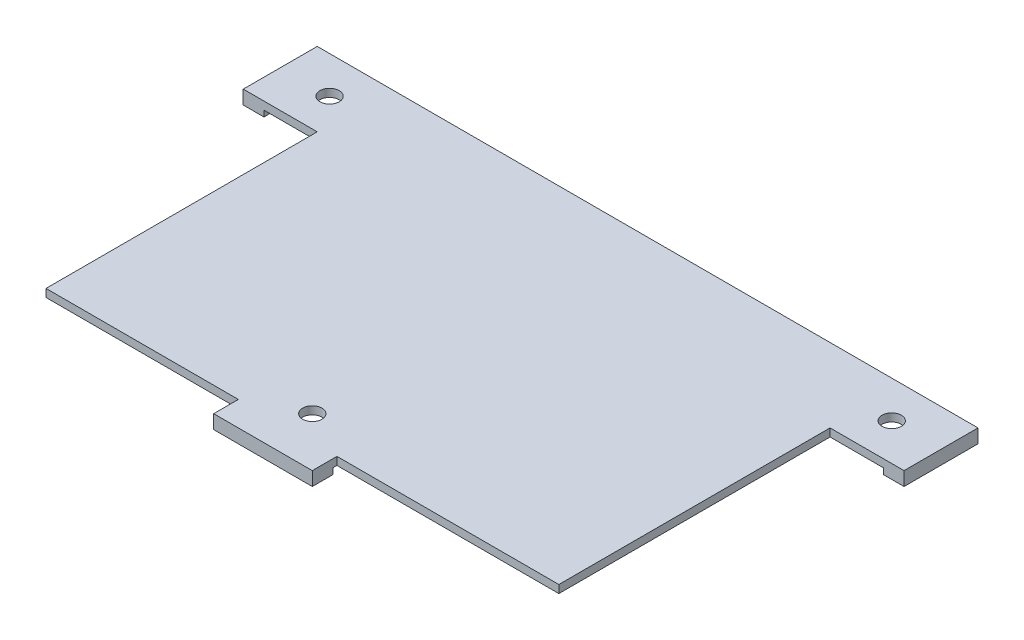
from build123d import *

# Parameters (mm, degrees)
SKETCH1_W           = 78.74
SKETCH1_H           = 44.45
SKETCH1_R           = 1.2446
BOSS_EXTRUDE1_DEPTH = 1.016
SKETCH2_W           = 3.175
SKETCH2_H           = 9.525
SKETCH2_W_2         = 12.7
SKETCH2_H_2         = 3.175
BOSS_EXTRUDE2_DEPTH = 1.778
SKETCH3_W           = 0.508
SKETCH3_H           = 9.525
SKETCH3_W_2         = 12.7
SKETCH3_H_2         = 0.508
CUT_EXTRUDE1_DEPTH  = 0.762
SKETCH4_W           = 6.35
SKETCH4_H           = 34.925
CUT_EXTRUDE2_DEPTH  = 61.684342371
CUT_EXTRUDE3_DEPTH  = 0.508


with BuildPart() as part:
    # Sketch1 → Boss-Extrude1 (new body)
    with BuildSketch(Plane(origin=(0, 0, 0), x_dir=(1, 0, 0), z_dir=(0, 1, 0))):
        with Locations((1.905, 19.05)):
            Rectangle(SKETCH1_W, SKETCH1_H)
        with Locations(Location((-34.29, 36.5125, 0), (0, 0, 270))):
            Circle(SKETCH1_R, mode=Mode.SUBTRACT)
        with Locations(Location((0, 0, 0), (0, 0, 270))):
            Circle(SKETCH1_R, mode=Mode.SUBTRACT)
        with Locations(Location((38.1, 36.5125, 0), (0, 0, 270))):
            Circle(SKETCH1_R, mode=Mode.SUBTRACT)
    extrude(amount=BOSS_EXTRUDE1_DEPTH)

    # Sketch2 → Boss-Extrude2 (add)
    with BuildSketch(Plane(origin=(0, 1.016, 0), x_dir=(1, 0, 0), z_dir=(0, 1, 0))):
        with Locations((-39.0525, 36.5125)):
            Rectangle(SKETCH2_W, SKETCH2_H)
        with Locations((0, -4.7625)):
            Rectangle(SKETCH2_W_2, SKETCH2_H_2)
        with Locations((42.8625, 36.5125)):
            Rectangle(SKETCH2_W, SKETCH2_H)
    extrude(amount=-BOSS_EXTRUDE2_DEPTH)

    # Sketch3 → Cut-Extrude1 (cut)
    with BuildSketch(Plane.XZ.offset(0.762)):
        with Locations((41.529, -36.5125)):
            Rectangle(SKETCH3_W, SKETCH3_H)
        with Locations((-37.719, -36.5125)):
            Rectangle(SKETCH3_W, SKETCH3_H)
        with Locations((0, 3.429)):
            Rectangle(SKETCH3_W_2, SKETCH3_H_2)
    extrude(amount=-CUT_EXTRUDE1_DEPTH, mode=Mode.SUBTRACT)

    # Sketch4 → Cut-Extrude2 (cut, through all)
    with BuildSketch(Plane(origin=(0, 1.016, 0), x_dir=(1, 0, 0), z_dir=(0, 1, 0))):
        with Locations((-34.29, 14.2875)):
            Rectangle(SKETCH4_W, SKETCH4_H)
        with Locations((38.1, 14.2875)):
            Rectangle(SKETCH4_W, SKETCH4_H)
    extrude(amount=-CUT_EXTRUDE2_DEPTH, mode=Mode.SUBTRACT)

    # Sketch5 → Cut-Extrude3 (cut)
    with BuildSketch(Plane.XZ):
        with BuildLine():
            add(Edge.make_bspline(
                [(3.134145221, -16.379848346), (3.152145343, -16.329716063), (3.185472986, -16.236894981), (3.256376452, -16.108494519), (3.370957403, -16.01159666), (3.534453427, -15.950235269), (3.748399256, -15.904089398), (3.967545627, -15.889946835), (4.177866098, -15.88366824), (4.366557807, -15.876977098), (4.578645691, -15.874409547), (4.727481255, -15.874795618), (4.806272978, -15.875)],
                knots=[0, 0, 0, 0, 0.844651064, 1.56389098, 2.296395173, 3.166964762, 4.304182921, 5.758768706, 6.638168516, 7.640850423, 8.751095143, 10, 10, 10, 10], degree=3))
            add(Edge.make_bspline(
                [(4.806272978, -15.875), (4.928851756, -15.874212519), (5.155543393, -15.872756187), (5.46960752, -15.881938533), (5.733733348, -15.882250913), (5.953401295, -15.902754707), (6.133959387, -15.921287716), (6.280086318, -15.958596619), (6.39859777, -16.00094709), (6.495077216, -16.055023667), (6.575101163, -16.118065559), (6.627400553, -16.203619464), (6.672200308, -16.299923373), (6.696060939, -16.370786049), (6.708938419, -16.409030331)],
                knots=[0, 0, 0, 0, 2.065582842, 3.8199953, 5.29577587, 6.512877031, 7.537701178, 8.348807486, 9.049138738, 9.651028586, 10.209371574, 10.741340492, 11.320706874, 12, 12, 12, 12], degree=3))
            Line((6.708938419, -16.409030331), (10.552205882, -27.56238511))
            add(Edge.make_bspline(
                [(10.552205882, -27.56238511), (10.569661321, -27.617835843), (10.602360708, -27.721712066), (10.649320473, -27.868277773), (10.676988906, -27.998520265), (10.696829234, -28.111278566), (10.701372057, -28.208711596), (10.688140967, -28.294666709), (10.651259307, -28.36691929), (10.59647296, -28.428031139), (10.520432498, -28.475048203), (10.423450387, -28.508345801), (10.307599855, -28.538157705), (10.167393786, -28.554287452), (10.002615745, -28.56019061), (9.809163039, -28.571504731), (9.586265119, -28.571606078), (9.427720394, -28.573827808), (9.344071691, -28.575)],
                knots=[0, 0, 0, 0, 1.276256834, 2.390820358, 3.375060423, 4.196456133, 4.901368, 5.508657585, 6.081569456, 6.656070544, 7.28980822, 8.019505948, 8.899837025, 9.911485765, 11.108865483, 12.51949737, 14.163675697, 16, 16, 16, 16], degree=3))
            add(Edge.make_bspline(
                [(9.344071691, -28.575), (9.272076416, -28.575763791), (9.136812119, -28.577198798), (8.946278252, -28.567817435), (8.779758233, -28.568171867), (8.600300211, -28.556837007), (8.419361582, -28.533827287), (8.244052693, -28.498212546), (8.115255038, -28.436651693), (8.033171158, -28.342676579), (7.982823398, -28.226842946), (7.953464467, -28.144246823), (7.9375, -28.09933364)],
                knots=[0, 0, 0, 0, 1.326763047, 2.492714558, 3.51483795, 4.39501526, 5.804941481, 6.874702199, 7.684698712, 8.383018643, 9.120736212, 10, 10, 10, 10], degree=3))
            Line((7.9375, -28.09933364), (4.771254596, -18.393405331))
            Line((4.771254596, -18.393405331), (4.7625, -18.393405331))
            Line((4.7625, -18.393405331), (1.774264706, -28.049724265))
            add(Edge.make_bspline(
                [(1.774264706, -28.049724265), (1.759735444, -28.099624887), (1.732922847, -28.191712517), (1.679962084, -28.317963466), (1.592573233, -28.420652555), (1.457521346, -28.488777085), (1.274439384, -28.537639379), (1.085014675, -28.555906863), (0.898970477, -28.568412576), (0.726566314, -28.567756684), (0.529234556, -28.577179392), (0.389106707, -28.57575278), (0.315165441, -28.575)],
                knots=[0, 0, 0, 0, 0.91043742, 1.680139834, 2.380365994, 3.219151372, 4.281370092, 5.688436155, 6.541625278, 7.546725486, 8.705480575, 10, 10, 10, 10], degree=3))
            add(Edge.make_bspline(
                [(0.315165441, -28.575), (0.243180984, -28.574258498), (0.106970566, -28.572855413), (-0.084725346, -28.567384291), (-0.251058, -28.558324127), (-0.392731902, -28.548903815), (-0.511132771, -28.528691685), (-0.610095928, -28.500357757), (-0.689505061, -28.461002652), (-0.76948072, -28.391483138), (-0.822435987, -28.25939506), (-0.81238704, -28.064710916), (-0.749112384, -27.823748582), (-0.68813878, -27.645578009), (-0.653676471, -27.544875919)],
                knots=[0, 0, 0, 0, 1.299602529, 2.459133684, 3.461472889, 4.307303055, 5.020401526, 5.625923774, 6.160008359, 6.607717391, 7.511704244, 8.60046101, 10.078579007, 12, 12, 12, 12], degree=3))
            Line((-0.653676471, -27.544875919), (3.134145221, -16.379848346))
        make_face()
        with BuildLine():
            add(Edge.make_bspline(
                [(-10.458823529, -16.88761489), (-10.456943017, -16.800016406), (-10.453489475, -16.639142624), (-10.434291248, -16.418523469), (-10.402553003, -16.239224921), (-10.35222736, -16.100899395), (-10.294292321, -15.998288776), (-10.227403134, -15.925500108), (-10.148440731, -15.880295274), (-10.090695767, -15.876759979), (-10.061948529, -15.875)],
                knots=[0, 0, 0, 0, 1.771487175, 3.253319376, 4.476326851, 5.441070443, 6.217065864, 6.843188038, 7.424103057, 8, 8, 8, 8], degree=3))
            Line((-10.061948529, -15.875), (-2.999908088, -15.875))
            add(Edge.make_bspline(
                [(-2.999908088, -15.875), (-2.973978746, -15.87683163), (-2.920662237, -15.880597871), (-2.848249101, -15.928456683), (-2.778759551, -15.996754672), (-2.721631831, -16.101244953), (-2.67068217, -16.239079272), (-2.640224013, -16.418752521), (-2.615236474, -16.638862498), (-2.614892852, -16.799959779), (-2.614705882, -16.88761489)],
                knots=[0, 0, 0, 0, 0.522562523, 1.074505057, 1.720647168, 2.504239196, 3.478427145, 4.713407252, 6.211722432, 8, 8, 8, 8], degree=3))
            add(Edge.make_bspline(
                [(-2.614705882, -16.88761489), (-2.615279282, -16.977156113), (-2.616328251, -17.140961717), (-2.636611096, -17.364396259), (-2.667285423, -17.546615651), (-2.710770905, -17.690856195), (-2.771631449, -17.79788769), (-2.838104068, -17.87541862), (-2.919574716, -17.920433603), (-2.977054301, -17.92642249), (-3.005744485, -17.929411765)],
                knots=[0, 0, 0, 0, 1.77343106, 3.244292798, 4.438837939, 5.432227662, 6.209101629, 6.863778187, 7.432869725, 8, 8, 8, 8], degree=3))
            Line((-3.005744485, -17.929411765), (-5.416176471, -17.929411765))
            Line((-5.416176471, -17.929411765), (-5.416176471, -25.960294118))
            Line((-5.416176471, -25.960294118), (-3.355928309, -24.839705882))
            add(Edge.make_bspline(
                [(-3.355928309, -24.839705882), (-3.287519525, -24.808499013), (-3.167657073, -24.753819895), (-3.000742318, -24.706051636), (-2.858617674, -24.694339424), (-2.744751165, -24.76398883), (-2.673491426, -24.894776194), (-2.636773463, -25.082899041), (-2.615214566, -25.341093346), (-2.614891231, -25.538057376), (-2.614705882, -25.650965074)],
                knots=[0, 0, 0, 0, 1.162412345, 2.03672083, 2.700285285, 3.295173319, 3.985778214, 4.947776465, 6.250342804, 8, 8, 8, 8], degree=3))
            add(Edge.make_bspline(
                [(-2.614705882, -25.650965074), (-2.615195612, -25.723931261), (-2.616084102, -25.856309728), (-2.623794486, -26.03656018), (-2.639746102, -26.185650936), (-2.670756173, -26.309072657), (-2.717179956, -26.412172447), (-2.783791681, -26.495135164), (-2.867923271, -26.571987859), (-2.934054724, -26.617767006), (-2.970726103, -26.643152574)],
                knots=[0, 0, 0, 0, 1.565715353, 2.840589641, 3.871072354, 4.77736535, 5.561752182, 6.275764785, 7.043872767, 8, 8, 8, 8], degree=3))
            Line((-2.970726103, -26.643152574), (-5.719669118, -28.443681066))
            add(Edge.make_bspline(
                [(-5.719669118, -28.443681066), (-5.737669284, -28.457128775), (-5.775998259, -28.485763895), (-5.849084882, -28.51462479), (-5.939275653, -28.532205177), (-6.049367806, -28.55620131), (-6.191427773, -28.564025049), (-6.371228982, -28.5743891), (-6.599043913, -28.575215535), (-6.767313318, -28.575076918), (-6.860684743, -28.575)],
                knots=[0, 0, 0, 0, 0.461896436, 0.983547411, 1.601620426, 2.357138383, 3.303531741, 4.528884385, 6.07390409, 8, 8, 8, 8], degree=3))
            add(Edge.make_bspline(
                [(-6.860684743, -28.575), (-6.975451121, -28.574698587), (-7.180749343, -28.57415941), (-7.454672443, -28.564848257), (-7.663567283, -28.542659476), (-7.818646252, -28.522773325), (-7.925826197, -28.481573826), (-7.997040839, -28.42661521), (-8.026754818, -28.351682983), (-8.029470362, -28.300854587), (-8.030882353, -28.274425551)],
                knots=[0, 0, 0, 0, 2.093727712, 3.74533535, 4.993527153, 5.929870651, 6.582266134, 7.073008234, 7.517995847, 8, 8, 8, 8], degree=3))
            Line((-8.030882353, -28.274425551), (-8.030882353, -17.929411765))
            Line((-8.030882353, -17.929411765), (-10.070703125, -17.929411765))
            add(Edge.make_bspline(
                [(-10.070703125, -17.929411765), (-10.099393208, -17.926422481), (-10.15687259, -17.920433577), (-10.238344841, -17.875418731), (-10.304810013, -17.797887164), (-10.365707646, -17.690858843), (-10.408998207, -17.546601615), (-10.440640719, -17.364548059), (-10.455953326, -17.140771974), (-10.457808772, -16.977118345), (-10.458823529, -16.88761489)],
                knots=[0, 0, 0, 0, 0.567246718, 1.136455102, 1.791266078, 2.568299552, 3.561893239, 4.756683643, 6.226204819, 8, 8, 8, 8], degree=3))
        make_face()
    extrude(amount=-CUT_EXTRUDE3_DEPTH, mode=Mode.SUBTRACT)


solid = part.part
